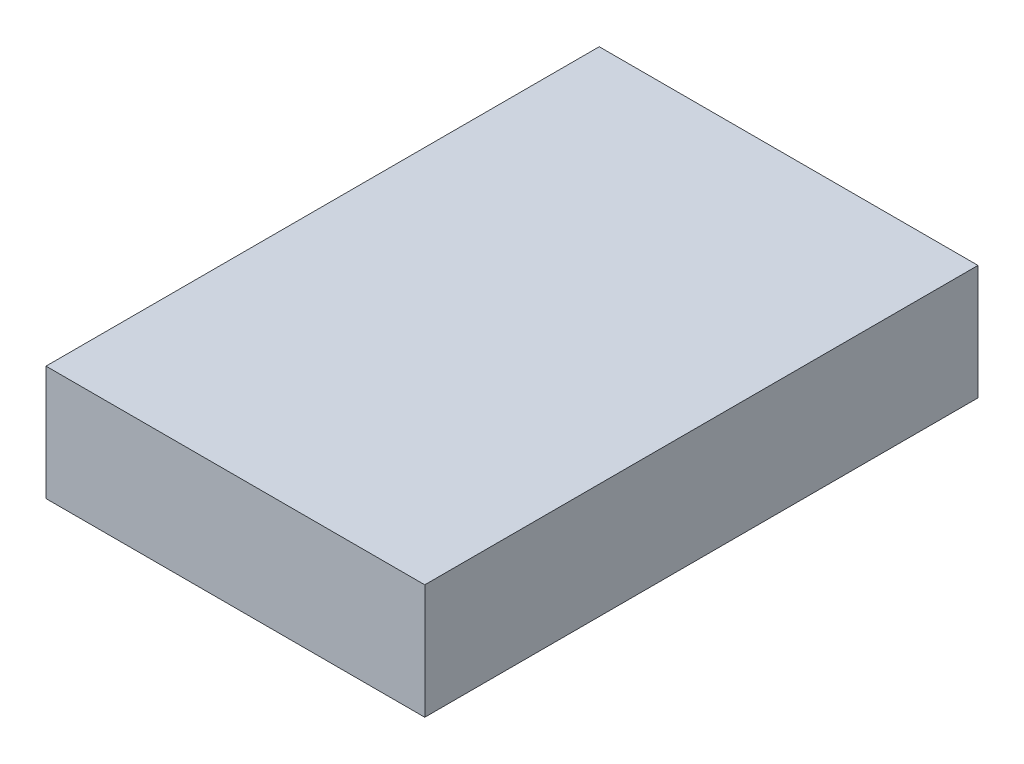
ISO-10303-21;
HEADER;
FILE_DESCRIPTION(('STEP AP214'),'2;1');
FILE_NAME('part.step','',(''),(''),'','','');
FILE_SCHEMA(('AUTOMOTIVE_DESIGN { 1 0 10303 214 1 1 1 1 }'));
ENDSEC;
DATA;
#1=APPLICATION_CONTEXT('core data for automotive mechanical design processes');
#2=APPLICATION_PROTOCOL_DEFINITION('international standard','automotive_design',2000,#1);
#3=PRODUCT_CONTEXT('',#1,'mechanical');
#4=PRODUCT('Part','Part','',(#3));
#5=PRODUCT_RELATED_PRODUCT_CATEGORY('part','',(#4));
#6=PRODUCT_DEFINITION_FORMATION('','',#4);
#7=PRODUCT_DEFINITION_CONTEXT('part definition',#1,'design');
#8=PRODUCT_DEFINITION('design','',#6,#7);
#9=PRODUCT_DEFINITION_SHAPE('','',#8);
#10=(LENGTH_UNIT() NAMED_UNIT(*) SI_UNIT(.MILLI.,.METRE.));
#11=(NAMED_UNIT(*) PLANE_ANGLE_UNIT() SI_UNIT($,.RADIAN.));
#12=(NAMED_UNIT(*) SI_UNIT($,.STERADIAN.) SOLID_ANGLE_UNIT());
#13=UNCERTAINTY_MEASURE_WITH_UNIT(LENGTH_MEASURE(1.E-05),#10,'distance_accuracy_value','');
#14=(GEOMETRIC_REPRESENTATION_CONTEXT(3) GLOBAL_UNCERTAINTY_ASSIGNED_CONTEXT((#13)) GLOBAL_UNIT_ASSIGNED_CONTEXT((#10,
#11,#12)) REPRESENTATION_CONTEXT('',''));
#15=CARTESIAN_POINT('',(0.,0.,0.));
#16=DIRECTION('',(0.,0.,1.));
#17=DIRECTION('',(1.,0.,0.));
#18=AXIS2_PLACEMENT_3D('',#15,#16,#17);
#19=CARTESIAN_POINT('',(-97.572202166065,21.2806859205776,176.));
#20=DIRECTION('',(1.,0.,0.));
#21=DIRECTION('',(0.,1.,0.));
#22=AXIS2_PLACEMENT_3D('',#19,#20,#21);
#23=PLANE('',#22);
#24=DIRECTION('',(0.,-1.,0.));
#25=VECTOR('',#24,1.);
#26=CARTESIAN_POINT('',(-97.572202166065,21.2806859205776,0.));
#27=LINE('',#26,#25);
#28=CARTESIAN_POINT('',(-97.572202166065,21.2806859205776,0.));
#29=VERTEX_POINT('',#28);
#30=CARTESIAN_POINT('',(-97.572202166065,-15.2193140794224,0.));
#31=VERTEX_POINT('',#30);
#32=EDGE_CURVE('E99',#29,#31,#27,.T.);
#33=ORIENTED_EDGE('',*,*,#32,.T.);
#34=DIRECTION('',(0.,0.,-1.));
#35=VECTOR('',#34,1.);
#36=CARTESIAN_POINT('',(-97.572202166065,-15.2193140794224,176.));
#37=LINE('',#36,#35);
#38=CARTESIAN_POINT('',(-97.572202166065,-15.2193140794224,176.));
#39=VERTEX_POINT('',#38);
#40=EDGE_CURVE('E11',#39,#31,#37,.T.);
#41=ORIENTED_EDGE('',*,*,#40,.F.);
#42=DIRECTION('',(0.,-1.,0.));
#43=VECTOR('',#42,1.);
#44=CARTESIAN_POINT('',(-97.572202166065,21.2806859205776,176.));
#45=LINE('',#44,#43);
#46=CARTESIAN_POINT('',(-97.572202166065,21.2806859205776,176.));
#47=VERTEX_POINT('',#46);
#48=EDGE_CURVE('E87',#47,#39,#45,.T.);
#49=ORIENTED_EDGE('',*,*,#48,.F.);
#50=DIRECTION('',(0.,0.,-1.));
#51=VECTOR('',#50,1.);
#52=CARTESIAN_POINT('',(-97.572202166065,21.2806859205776,176.));
#53=LINE('',#52,#51);
#54=EDGE_CURVE('E95',#47,#29,#53,.T.);
#55=ORIENTED_EDGE('',*,*,#54,.T.);
#56=EDGE_LOOP('',(#33,#41,#49,#55));
#57=FACE_BOUND('',#56,.T.);
#58=ADVANCED_FACE('F36',(#57),#23,.F.);
#59=CARTESIAN_POINT('',(-97.572202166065,-15.2193140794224,176.));
#60=DIRECTION('',(0.,1.,0.));
#61=DIRECTION('',(-1.,0.,0.));
#62=AXIS2_PLACEMENT_3D('',#59,#60,#61);
#63=PLANE('',#62);
#64=DIRECTION('',(1.,0.,0.));
#65=VECTOR('',#64,1.);
#66=CARTESIAN_POINT('',(-97.572202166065,-15.2193140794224,0.));
#67=LINE('',#66,#65);
#68=CARTESIAN_POINT('',(22.927797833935,-15.2193140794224,0.));
#69=VERTEX_POINT('',#68);
#70=EDGE_CURVE('E91',#31,#69,#67,.T.);
#71=ORIENTED_EDGE('',*,*,#70,.T.);
#72=DIRECTION('',(0.,0.,-1.));
#73=VECTOR('',#72,1.);
#74=CARTESIAN_POINT('',(22.927797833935,-15.2193140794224,176.));
#75=LINE('',#74,#73);
#76=CARTESIAN_POINT('',(22.927797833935,-15.2193140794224,176.));
#77=VERTEX_POINT('',#76);
#78=EDGE_CURVE('E44',#77,#69,#75,.T.);
#79=ORIENTED_EDGE('',*,*,#78,.F.);
#80=DIRECTION('',(1.,0.,0.));
#81=VECTOR('',#80,1.);
#82=CARTESIAN_POINT('',(-97.572202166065,-15.2193140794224,176.));
#83=LINE('',#82,#81);
#84=EDGE_CURVE('E82',#39,#77,#83,.T.);
#85=ORIENTED_EDGE('',*,*,#84,.F.);
#86=ORIENTED_EDGE('',*,*,#40,.T.);
#87=EDGE_LOOP('',(#71,#79,#85,#86));
#88=FACE_BOUND('',#87,.T.);
#89=ADVANCED_FACE('F90',(#88),#63,.F.);
#90=CARTESIAN_POINT('',(22.927797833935,21.2806859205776,176.));
#91=DIRECTION('',(-1.,0.,0.));
#92=DIRECTION('',(0.,0.,1.));
#93=AXIS2_PLACEMENT_3D('',#90,#91,#92);
#94=PLANE('',#93);
#95=DIRECTION('',(0.,1.,0.));
#96=VECTOR('',#95,1.);
#97=CARTESIAN_POINT('',(22.927797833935,21.2806859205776,0.));
#98=LINE('',#97,#96);
#99=CARTESIAN_POINT('',(22.927797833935,21.2806859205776,0.));
#100=VERTEX_POINT('',#99);
#101=EDGE_CURVE('E69',#69,#100,#98,.T.);
#102=ORIENTED_EDGE('',*,*,#101,.T.);
#103=DIRECTION('',(0.,0.,-1.));
#104=VECTOR('',#103,1.);
#105=CARTESIAN_POINT('',(22.927797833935,21.2806859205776,176.));
#106=LINE('',#105,#104);
#107=CARTESIAN_POINT('',(22.927797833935,21.2806859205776,176.));
#108=VERTEX_POINT('',#107);
#109=EDGE_CURVE('E92',#108,#100,#106,.T.);
#110=ORIENTED_EDGE('',*,*,#109,.F.);
#111=DIRECTION('',(0.,1.,0.));
#112=VECTOR('',#111,1.);
#113=CARTESIAN_POINT('',(22.927797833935,21.2806859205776,176.));
#114=LINE('',#113,#112);
#115=EDGE_CURVE('E85',#77,#108,#114,.T.);
#116=ORIENTED_EDGE('',*,*,#115,.F.);
#117=ORIENTED_EDGE('',*,*,#78,.T.);
#118=EDGE_LOOP('',(#102,#110,#116,#117));
#119=FACE_BOUND('',#118,.T.);
#120=ADVANCED_FACE('F93',(#119),#94,.F.);
#121=CARTESIAN_POINT('',(-97.572202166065,21.2806859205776,176.));
#122=DIRECTION('',(0.,-1.,0.));
#123=DIRECTION('',(0.,0.,-1.));
#124=AXIS2_PLACEMENT_3D('',#121,#122,#123);
#125=PLANE('',#124);
#126=DIRECTION('',(-1.,0.,0.));
#127=VECTOR('',#126,1.);
#128=CARTESIAN_POINT('',(-97.572202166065,21.2806859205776,0.));
#129=LINE('',#128,#127);
#130=EDGE_CURVE('E75',#100,#29,#129,.T.);
#131=ORIENTED_EDGE('',*,*,#130,.T.);
#132=ORIENTED_EDGE('',*,*,#54,.F.);
#133=DIRECTION('',(-1.,0.,0.));
#134=VECTOR('',#133,1.);
#135=CARTESIAN_POINT('',(-97.572202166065,21.2806859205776,176.));
#136=LINE('',#135,#134);
#137=EDGE_CURVE('E52',#108,#47,#136,.T.);
#138=ORIENTED_EDGE('',*,*,#137,.F.);
#139=ORIENTED_EDGE('',*,*,#109,.T.);
#140=EDGE_LOOP('',(#131,#132,#138,#139));
#141=FACE_BOUND('',#140,.T.);
#142=ADVANCED_FACE('F107',(#141),#125,.F.);
#143=CARTESIAN_POINT('',(0.,0.,176.));
#144=DIRECTION('',(0.,0.,1.));
#145=DIRECTION('',(1.,0.,0.));
#146=AXIS2_PLACEMENT_3D('',#143,#144,#145);
#147=PLANE('',#146);
#148=ORIENTED_EDGE('',*,*,#48,.T.);
#149=ORIENTED_EDGE('',*,*,#84,.T.);
#150=ORIENTED_EDGE('',*,*,#115,.T.);
#151=ORIENTED_EDGE('',*,*,#137,.T.);
#152=EDGE_LOOP('',(#148,#149,#150,#151));
#153=FACE_BOUND('',#152,.T.);
#154=ADVANCED_FACE('F83',(#153),#147,.T.);
#155=CARTESIAN_POINT('',(0.,0.,0.));
#156=DIRECTION('',(0.,0.,1.));
#157=DIRECTION('',(1.,0.,0.));
#158=AXIS2_PLACEMENT_3D('',#155,#156,#157);
#159=PLANE('',#158);
#160=CARTESIAN_POINT('',(-72.572202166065,-5.21931407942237,0.));
#161=DIRECTION('',(0.,0.,-1.));
#162=DIRECTION('',(-1.,0.,0.));
#163=AXIS2_PLACEMENT_3D('',#160,#161,#162);
#164=CIRCLE('',#163,3.00000000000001);
#165=CARTESIAN_POINT('',(-75.572202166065,-5.21931407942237,0.));
#166=VERTEX_POINT('',#165);
#167=EDGE_CURVE('E113',#166,#166,#164,.T.);
#168=ORIENTED_EDGE('',*,*,#167,.F.);
#169=EDGE_LOOP('',(#168));
#170=FACE_BOUND('',#169,.T.);
#171=ORIENTED_EDGE('',*,*,#32,.F.);
#172=ORIENTED_EDGE('',*,*,#130,.F.);
#173=ORIENTED_EDGE('',*,*,#101,.F.);
#174=ORIENTED_EDGE('',*,*,#70,.F.);
#175=EDGE_LOOP('',(#171,#172,#173,#174));
#176=FACE_BOUND('',#175,.T.);
#177=ADVANCED_FACE('F110',(#170,#176),#159,.F.);
#178=CARTESIAN_POINT('',(-72.572202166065,-5.21931407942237,10.));
#179=DIRECTION('',(0.,0.,-1.));
#180=DIRECTION('',(-1.,0.,0.));
#181=AXIS2_PLACEMENT_3D('',#178,#179,#180);
#182=CYLINDRICAL_SURFACE('',#181,3.00000000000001);
#183=CARTESIAN_POINT('',(-72.572202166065,-5.21931407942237,10.));
#184=DIRECTION('',(0.,0.,-1.));
#185=DIRECTION('',(-1.,0.,0.));
#186=AXIS2_PLACEMENT_3D('',#183,#184,#185);
#187=CIRCLE('',#186,3.00000000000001);
#188=CARTESIAN_POINT('',(-75.572202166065,-5.21931407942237,10.));
#189=VERTEX_POINT('',#188);
#190=EDGE_CURVE('E102',#189,#189,#187,.T.);
#191=ORIENTED_EDGE('',*,*,#190,.F.);
#192=EDGE_LOOP('',(#191));
#193=FACE_BOUND('',#192,.T.);
#194=ORIENTED_EDGE('',*,*,#167,.T.);
#195=EDGE_LOOP('',(#194));
#196=FACE_BOUND('',#195,.T.);
#197=ADVANCED_FACE('F121',(#193,#196),#182,.F.);
#198=CARTESIAN_POINT('',(-72.572202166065,-5.21931407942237,10.));
#199=DIRECTION('',(0.,0.,-1.));
#200=DIRECTION('',(-1.,0.,0.));
#201=AXIS2_PLACEMENT_3D('',#198,#199,#200);
#202=PLANE('',#201);
#203=ORIENTED_EDGE('',*,*,#190,.T.);
#204=EDGE_LOOP('',(#203));
#205=FACE_BOUND('',#204,.T.);
#206=ADVANCED_FACE('F119',(#205),#202,.T.);
#207=CLOSED_SHELL('',(#58,#89,#120,#142,#154,#177,#197,#206));
#208=MANIFOLD_SOLID_BREP('B2',#207);
#209=ADVANCED_BREP_SHAPE_REPRESENTATION('',(#18,#208),#14);
#210=SHAPE_DEFINITION_REPRESENTATION(#9,#209);
ENDSEC;
END-ISO-10303-21;
